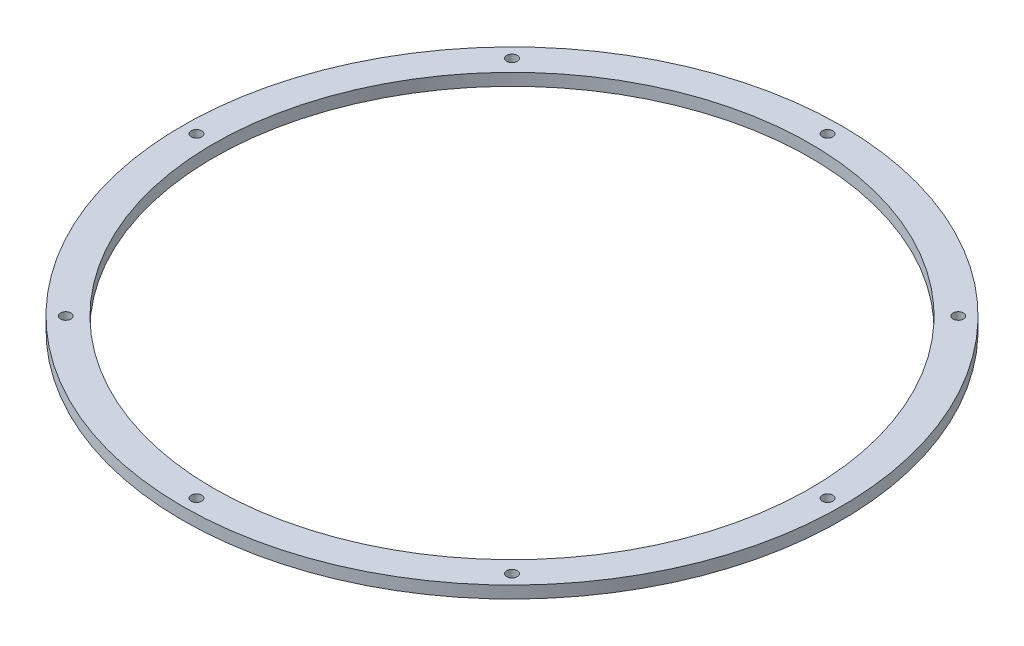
ISO-10303-21;
HEADER;
FILE_DESCRIPTION(('STEP AP214'),'2;1');
FILE_NAME('part.step','',(''),(''),'','','');
FILE_SCHEMA(('AUTOMOTIVE_DESIGN { 1 0 10303 214 1 1 1 1 }'));
ENDSEC;
DATA;
#1=APPLICATION_CONTEXT('core data for automotive mechanical design processes');
#2=APPLICATION_PROTOCOL_DEFINITION('international standard','automotive_design',2000,#1);
#3=PRODUCT_CONTEXT('',#1,'mechanical');
#4=PRODUCT('Part','Part','',(#3));
#5=PRODUCT_RELATED_PRODUCT_CATEGORY('part','',(#4));
#6=PRODUCT_DEFINITION_FORMATION('','',#4);
#7=PRODUCT_DEFINITION_CONTEXT('part definition',#1,'design');
#8=PRODUCT_DEFINITION('design','',#6,#7);
#9=PRODUCT_DEFINITION_SHAPE('','',#8);
#10=(LENGTH_UNIT() NAMED_UNIT(*) SI_UNIT(.MILLI.,.METRE.));
#11=(NAMED_UNIT(*) PLANE_ANGLE_UNIT() SI_UNIT($,.RADIAN.));
#12=(NAMED_UNIT(*) SI_UNIT($,.STERADIAN.) SOLID_ANGLE_UNIT());
#13=UNCERTAINTY_MEASURE_WITH_UNIT(LENGTH_MEASURE(1.E-05),#10,'distance_accuracy_value','');
#14=(GEOMETRIC_REPRESENTATION_CONTEXT(3) GLOBAL_UNCERTAINTY_ASSIGNED_CONTEXT((#13)) GLOBAL_UNIT_ASSIGNED_CONTEXT((#10,
#11,#12)) REPRESENTATION_CONTEXT('',''));
#15=CARTESIAN_POINT('',(0.,0.,0.));
#16=DIRECTION('',(0.,0.,1.));
#17=DIRECTION('',(1.,0.,0.));
#18=AXIS2_PLACEMENT_3D('',#15,#16,#17);
#19=CARTESIAN_POINT('',(0.,4.953,0.));
#20=DIRECTION('',(0.,1.,0.));
#21=DIRECTION('',(0.,0.,1.));
#22=AXIS2_PLACEMENT_3D('',#19,#20,#21);
#23=PLANE('',#22);
#24=CARTESIAN_POINT('',(91.1495996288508,4.953,-91.149599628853));
#25=DIRECTION('',(0.,1.,0.));
#26=DIRECTION('',(0.,0.,1.));
#27=AXIS2_PLACEMENT_3D('',#24,#25,#26);
#28=CIRCLE('',#27,2.15);
#29=CARTESIAN_POINT('',(91.1495996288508,4.953,-88.999599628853));
#30=VERTEX_POINT('',#29);
#31=EDGE_CURVE('E102',#30,#30,#28,.T.);
#32=ORIENTED_EDGE('',*,*,#31,.F.);
#33=EDGE_LOOP('',(#32));
#34=FACE_BOUND('',#33,.T.);
#35=CARTESIAN_POINT('',(128.905,4.953,-1.35020820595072E-12));
#36=DIRECTION('',(0.,1.,0.));
#37=DIRECTION('',(0.,0.,1.));
#38=AXIS2_PLACEMENT_3D('',#35,#36,#37);
#39=CIRCLE('',#38,2.15000000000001);
#40=CARTESIAN_POINT('',(128.905,4.953,2.14999999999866));
#41=VERTEX_POINT('',#40);
#42=EDGE_CURVE('E96',#41,#41,#39,.T.);
#43=ORIENTED_EDGE('',*,*,#42,.F.);
#44=EDGE_LOOP('',(#43));
#45=FACE_BOUND('',#44,.T.);
#46=CARTESIAN_POINT('',(91.1495996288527,4.953,91.1495996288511));
#47=DIRECTION('',(0.,1.,0.));
#48=DIRECTION('',(0.,0.,1.));
#49=AXIS2_PLACEMENT_3D('',#46,#47,#48);
#50=CIRCLE('',#49,2.15);
#51=CARTESIAN_POINT('',(91.1495996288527,4.953,93.2995996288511));
#52=VERTEX_POINT('',#51);
#53=EDGE_CURVE('E90',#52,#52,#50,.T.);
#54=ORIENTED_EDGE('',*,*,#53,.F.);
#55=EDGE_LOOP('',(#54));
#56=FACE_BOUND('',#55,.T.);
#57=CARTESIAN_POINT('',(0.,4.953,128.905));
#58=DIRECTION('',(0.,1.,0.));
#59=DIRECTION('',(0.,0.,1.));
#60=AXIS2_PLACEMENT_3D('',#57,#58,#59);
#61=CIRCLE('',#60,2.15);
#62=CARTESIAN_POINT('',(0.,4.953,131.055));
#63=VERTEX_POINT('',#62);
#64=EDGE_CURVE('E84',#63,#63,#61,.T.);
#65=ORIENTED_EDGE('',*,*,#64,.F.);
#66=EDGE_LOOP('',(#65));
#67=FACE_BOUND('',#66,.T.);
#68=CARTESIAN_POINT('',(-91.1495996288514,4.953,91.1495996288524));
#69=DIRECTION('',(0.,1.,0.));
#70=DIRECTION('',(0.,0.,1.));
#71=AXIS2_PLACEMENT_3D('',#68,#69,#70);
#72=CIRCLE('',#71,2.15);
#73=CARTESIAN_POINT('',(-91.1495996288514,4.953,93.2995996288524));
#74=VERTEX_POINT('',#73);
#75=EDGE_CURVE('E78',#74,#74,#72,.T.);
#76=ORIENTED_EDGE('',*,*,#75,.F.);
#77=EDGE_LOOP('',(#76));
#78=FACE_BOUND('',#77,.T.);
#79=CARTESIAN_POINT('',(-128.905,4.953,4.50069401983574E-13));
#80=DIRECTION('',(0.,1.,0.));
#81=DIRECTION('',(0.,0.,1.));
#82=AXIS2_PLACEMENT_3D('',#79,#80,#81);
#83=CIRCLE('',#82,2.15000000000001);
#84=CARTESIAN_POINT('',(-128.905,4.953,2.15000000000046));
#85=VERTEX_POINT('',#84);
#86=EDGE_CURVE('E72',#85,#85,#83,.T.);
#87=ORIENTED_EDGE('',*,*,#86,.F.);
#88=EDGE_LOOP('',(#87));
#89=FACE_BOUND('',#88,.T.);
#90=CARTESIAN_POINT('',(-91.1495996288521,4.953,-91.1495996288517));
#91=DIRECTION('',(0.,1.,0.));
#92=DIRECTION('',(0.,0.,1.));
#93=AXIS2_PLACEMENT_3D('',#90,#91,#92);
#94=CIRCLE('',#93,2.15);
#95=CARTESIAN_POINT('',(-91.1495996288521,4.953,-88.9995996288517));
#96=VERTEX_POINT('',#95);
#97=EDGE_CURVE('E66',#96,#96,#94,.T.);
#98=ORIENTED_EDGE('',*,*,#97,.F.);
#99=EDGE_LOOP('',(#98));
#100=FACE_BOUND('',#99,.T.);
#101=CARTESIAN_POINT('',(0.,4.953,-128.905));
#102=DIRECTION('',(0.,1.,0.));
#103=DIRECTION('',(0.,0.,1.));
#104=AXIS2_PLACEMENT_3D('',#101,#102,#103);
#105=CIRCLE('',#104,2.15);
#106=CARTESIAN_POINT('',(0.,4.953,-126.755));
#107=VERTEX_POINT('',#106);
#108=EDGE_CURVE('E60',#107,#107,#105,.T.);
#109=ORIENTED_EDGE('',*,*,#108,.F.);
#110=EDGE_LOOP('',(#109));
#111=FACE_BOUND('',#110,.T.);
#112=CARTESIAN_POINT('',(0.,4.953,0.));
#113=DIRECTION('',(0.,1.,0.));
#114=DIRECTION('',(0.,0.,1.));
#115=AXIS2_PLACEMENT_3D('',#112,#113,#114);
#116=CIRCLE('',#115,134.62);
#117=CARTESIAN_POINT('',(0.,4.953,134.62));
#118=VERTEX_POINT('',#117);
#119=EDGE_CURVE('E10',#118,#118,#116,.T.);
#120=ORIENTED_EDGE('',*,*,#119,.T.);
#121=EDGE_LOOP('',(#120));
#122=FACE_BOUND('',#121,.T.);
#123=CARTESIAN_POINT('',(0.,4.953,0.));
#124=DIRECTION('',(0.,1.,0.));
#125=DIRECTION('',(0.,0.,1.));
#126=AXIS2_PLACEMENT_3D('',#123,#124,#125);
#127=CIRCLE('',#126,121.92);
#128=CARTESIAN_POINT('',(0.,4.953,121.92));
#129=VERTEX_POINT('',#128);
#130=EDGE_CURVE('E50',#129,#129,#127,.T.);
#131=ORIENTED_EDGE('',*,*,#130,.F.);
#132=EDGE_LOOP('',(#131));
#133=FACE_BOUND('',#132,.T.);
#134=ADVANCED_FACE('F39',(#34,#45,#56,#67,#78,#89,#100,#111,#122,#133),#23,.T.);
#135=CARTESIAN_POINT('',(0.,0.,0.));
#136=DIRECTION('',(0.,1.,0.));
#137=DIRECTION('',(0.,0.,1.));
#138=AXIS2_PLACEMENT_3D('',#135,#136,#137);
#139=PLANE('',#138);
#140=CARTESIAN_POINT('',(91.1495996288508,0.,-91.149599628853));
#141=DIRECTION('',(0.,1.,0.));
#142=DIRECTION('',(0.,0.,1.));
#143=AXIS2_PLACEMENT_3D('',#140,#141,#142);
#144=CIRCLE('',#143,2.15);
#145=CARTESIAN_POINT('',(91.1495996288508,0.,-88.999599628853));
#146=VERTEX_POINT('',#145);
#147=EDGE_CURVE('E99',#146,#146,#144,.T.);
#148=ORIENTED_EDGE('',*,*,#147,.T.);
#149=EDGE_LOOP('',(#148));
#150=FACE_BOUND('',#149,.T.);
#151=CARTESIAN_POINT('',(128.905,0.,-1.35020820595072E-12));
#152=DIRECTION('',(0.,1.,0.));
#153=DIRECTION('',(0.,0.,1.));
#154=AXIS2_PLACEMENT_3D('',#151,#152,#153);
#155=CIRCLE('',#154,2.14999999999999);
#156=CARTESIAN_POINT('',(128.905,0.,2.14999999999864));
#157=VERTEX_POINT('',#156);
#158=EDGE_CURVE('E93',#157,#157,#155,.T.);
#159=ORIENTED_EDGE('',*,*,#158,.T.);
#160=EDGE_LOOP('',(#159));
#161=FACE_BOUND('',#160,.T.);
#162=CARTESIAN_POINT('',(91.1495996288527,0.,91.1495996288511));
#163=DIRECTION('',(0.,1.,0.));
#164=DIRECTION('',(0.,0.,1.));
#165=AXIS2_PLACEMENT_3D('',#162,#163,#164);
#166=CIRCLE('',#165,2.15);
#167=CARTESIAN_POINT('',(91.1495996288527,0.,93.2995996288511));
#168=VERTEX_POINT('',#167);
#169=EDGE_CURVE('E87',#168,#168,#166,.T.);
#170=ORIENTED_EDGE('',*,*,#169,.T.);
#171=EDGE_LOOP('',(#170));
#172=FACE_BOUND('',#171,.T.);
#173=CARTESIAN_POINT('',(0.,0.,128.905));
#174=DIRECTION('',(0.,1.,0.));
#175=DIRECTION('',(0.,0.,1.));
#176=AXIS2_PLACEMENT_3D('',#173,#174,#175);
#177=CIRCLE('',#176,2.15);
#178=CARTESIAN_POINT('',(0.,0.,131.055));
#179=VERTEX_POINT('',#178);
#180=EDGE_CURVE('E81',#179,#179,#177,.T.);
#181=ORIENTED_EDGE('',*,*,#180,.T.);
#182=EDGE_LOOP('',(#181));
#183=FACE_BOUND('',#182,.T.);
#184=CARTESIAN_POINT('',(-91.1495996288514,0.,91.1495996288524));
#185=DIRECTION('',(0.,1.,0.));
#186=DIRECTION('',(0.,0.,1.));
#187=AXIS2_PLACEMENT_3D('',#184,#185,#186);
#188=CIRCLE('',#187,2.15);
#189=CARTESIAN_POINT('',(-91.1495996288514,0.,93.2995996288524));
#190=VERTEX_POINT('',#189);
#191=EDGE_CURVE('E75',#190,#190,#188,.T.);
#192=ORIENTED_EDGE('',*,*,#191,.T.);
#193=EDGE_LOOP('',(#192));
#194=FACE_BOUND('',#193,.T.);
#195=CARTESIAN_POINT('',(-128.905,0.,4.50069401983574E-13));
#196=DIRECTION('',(0.,1.,0.));
#197=DIRECTION('',(0.,0.,1.));
#198=AXIS2_PLACEMENT_3D('',#195,#196,#197);
#199=CIRCLE('',#198,2.14999999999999);
#200=CARTESIAN_POINT('',(-128.905,0.,2.15000000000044));
#201=VERTEX_POINT('',#200);
#202=EDGE_CURVE('E69',#201,#201,#199,.T.);
#203=ORIENTED_EDGE('',*,*,#202,.T.);
#204=EDGE_LOOP('',(#203));
#205=FACE_BOUND('',#204,.T.);
#206=CARTESIAN_POINT('',(-91.1495996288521,0.,-91.1495996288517));
#207=DIRECTION('',(0.,1.,0.));
#208=DIRECTION('',(0.,0.,1.));
#209=AXIS2_PLACEMENT_3D('',#206,#207,#208);
#210=CIRCLE('',#209,2.15);
#211=CARTESIAN_POINT('',(-91.1495996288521,0.,-88.9995996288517));
#212=VERTEX_POINT('',#211);
#213=EDGE_CURVE('E63',#212,#212,#210,.T.);
#214=ORIENTED_EDGE('',*,*,#213,.T.);
#215=EDGE_LOOP('',(#214));
#216=FACE_BOUND('',#215,.T.);
#217=CARTESIAN_POINT('',(0.,0.,-128.905));
#218=DIRECTION('',(0.,1.,0.));
#219=DIRECTION('',(0.,0.,1.));
#220=AXIS2_PLACEMENT_3D('',#217,#218,#219);
#221=CIRCLE('',#220,2.15);
#222=CARTESIAN_POINT('',(0.,0.,-126.755));
#223=VERTEX_POINT('',#222);
#224=EDGE_CURVE('E55',#223,#223,#221,.T.);
#225=ORIENTED_EDGE('',*,*,#224,.T.);
#226=EDGE_LOOP('',(#225));
#227=FACE_BOUND('',#226,.T.);
#228=CARTESIAN_POINT('',(0.,0.,0.));
#229=DIRECTION('',(0.,1.,0.));
#230=DIRECTION('',(0.,0.,1.));
#231=AXIS2_PLACEMENT_3D('',#228,#229,#230);
#232=CIRCLE('',#231,134.62);
#233=CARTESIAN_POINT('',(0.,0.,134.62));
#234=VERTEX_POINT('',#233);
#235=EDGE_CURVE('E43',#234,#234,#232,.T.);
#236=ORIENTED_EDGE('',*,*,#235,.F.);
#237=EDGE_LOOP('',(#236));
#238=FACE_BOUND('',#237,.T.);
#239=CARTESIAN_POINT('',(0.,0.,0.));
#240=DIRECTION('',(0.,1.,0.));
#241=DIRECTION('',(0.,0.,1.));
#242=AXIS2_PLACEMENT_3D('',#239,#240,#241);
#243=CIRCLE('',#242,121.92);
#244=CARTESIAN_POINT('',(0.,0.,121.92));
#245=VERTEX_POINT('',#244);
#246=EDGE_CURVE('E52',#245,#245,#243,.T.);
#247=ORIENTED_EDGE('',*,*,#246,.T.);
#248=EDGE_LOOP('',(#247));
#249=FACE_BOUND('',#248,.T.);
#250=ADVANCED_FACE('F110',(#150,#161,#172,#183,#194,#205,#216,#227,#238,#249),#139,.F.);
#251=CARTESIAN_POINT('',(0.,4.953,0.));
#252=DIRECTION('',(0.,-1.,0.));
#253=DIRECTION('',(0.,0.,-1.));
#254=AXIS2_PLACEMENT_3D('',#251,#252,#253);
#255=CYLINDRICAL_SURFACE('',#254,134.62);
#256=ORIENTED_EDGE('',*,*,#119,.F.);
#257=EDGE_LOOP('',(#256));
#258=FACE_BOUND('',#257,.T.);
#259=ORIENTED_EDGE('',*,*,#235,.T.);
#260=EDGE_LOOP('',(#259));
#261=FACE_BOUND('',#260,.T.);
#262=ADVANCED_FACE('F41',(#258,#261),#255,.T.);
#263=CARTESIAN_POINT('',(0.,4.953,0.));
#264=DIRECTION('',(0.,-1.,0.));
#265=DIRECTION('',(0.,0.,-1.));
#266=AXIS2_PLACEMENT_3D('',#263,#264,#265);
#267=CYLINDRICAL_SURFACE('',#266,121.92);
#268=ORIENTED_EDGE('',*,*,#130,.T.);
#269=EDGE_LOOP('',(#268));
#270=FACE_BOUND('',#269,.T.);
#271=ORIENTED_EDGE('',*,*,#246,.F.);
#272=EDGE_LOOP('',(#271));
#273=FACE_BOUND('',#272,.T.);
#274=ADVANCED_FACE('F128',(#270,#273),#267,.F.);
#275=CARTESIAN_POINT('',(0.,4.953,-128.905));
#276=DIRECTION('',(0.,1.,0.));
#277=DIRECTION('',(0.,0.,1.));
#278=AXIS2_PLACEMENT_3D('',#275,#276,#277);
#279=CYLINDRICAL_SURFACE('',#278,2.15);
#280=ORIENTED_EDGE('',*,*,#224,.F.);
#281=EDGE_LOOP('',(#280));
#282=FACE_BOUND('',#281,.T.);
#283=ORIENTED_EDGE('',*,*,#108,.T.);
#284=EDGE_LOOP('',(#283));
#285=FACE_BOUND('',#284,.T.);
#286=ADVANCED_FACE('F131',(#282,#285),#279,.F.);
#287=CARTESIAN_POINT('',(-91.1495996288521,4.953,-91.1495996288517));
#288=DIRECTION('',(0.,1.,0.));
#289=DIRECTION('',(0.,0.,1.));
#290=AXIS2_PLACEMENT_3D('',#287,#288,#289);
#291=CYLINDRICAL_SURFACE('',#290,2.15);
#292=ORIENTED_EDGE('',*,*,#213,.F.);
#293=EDGE_LOOP('',(#292));
#294=FACE_BOUND('',#293,.T.);
#295=ORIENTED_EDGE('',*,*,#97,.T.);
#296=EDGE_LOOP('',(#295));
#297=FACE_BOUND('',#296,.T.);
#298=ADVANCED_FACE('F145',(#294,#297),#291,.F.);
#299=CARTESIAN_POINT('',(-128.905,4.953,4.50069401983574E-13));
#300=DIRECTION('',(0.,1.,0.));
#301=DIRECTION('',(0.,0.,1.));
#302=AXIS2_PLACEMENT_3D('',#299,#300,#301);
#303=CYLINDRICAL_SURFACE('',#302,2.15);
#304=ORIENTED_EDGE('',*,*,#202,.F.);
#305=EDGE_LOOP('',(#304));
#306=FACE_BOUND('',#305,.T.);
#307=ORIENTED_EDGE('',*,*,#86,.T.);
#308=EDGE_LOOP('',(#307));
#309=FACE_BOUND('',#308,.T.);
#310=ADVANCED_FACE('F149',(#306,#309),#303,.F.);
#311=CARTESIAN_POINT('',(-91.1495996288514,4.953,91.1495996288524));
#312=DIRECTION('',(0.,1.,0.));
#313=DIRECTION('',(0.,0.,1.));
#314=AXIS2_PLACEMENT_3D('',#311,#312,#313);
#315=CYLINDRICAL_SURFACE('',#314,2.15);
#316=ORIENTED_EDGE('',*,*,#191,.F.);
#317=EDGE_LOOP('',(#316));
#318=FACE_BOUND('',#317,.T.);
#319=ORIENTED_EDGE('',*,*,#75,.T.);
#320=EDGE_LOOP('',(#319));
#321=FACE_BOUND('',#320,.T.);
#322=ADVANCED_FACE('F153',(#318,#321),#315,.F.);
#323=CARTESIAN_POINT('',(0.,4.953,128.905));
#324=DIRECTION('',(0.,1.,0.));
#325=DIRECTION('',(0.,0.,1.));
#326=AXIS2_PLACEMENT_3D('',#323,#324,#325);
#327=CYLINDRICAL_SURFACE('',#326,2.15);
#328=ORIENTED_EDGE('',*,*,#180,.F.);
#329=EDGE_LOOP('',(#328));
#330=FACE_BOUND('',#329,.T.);
#331=ORIENTED_EDGE('',*,*,#64,.T.);
#332=EDGE_LOOP('',(#331));
#333=FACE_BOUND('',#332,.T.);
#334=ADVANCED_FACE('F157',(#330,#333),#327,.F.);
#335=CARTESIAN_POINT('',(91.1495996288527,4.953,91.1495996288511));
#336=DIRECTION('',(0.,1.,0.));
#337=DIRECTION('',(0.,0.,1.));
#338=AXIS2_PLACEMENT_3D('',#335,#336,#337);
#339=CYLINDRICAL_SURFACE('',#338,2.15);
#340=ORIENTED_EDGE('',*,*,#169,.F.);
#341=EDGE_LOOP('',(#340));
#342=FACE_BOUND('',#341,.T.);
#343=ORIENTED_EDGE('',*,*,#53,.T.);
#344=EDGE_LOOP('',(#343));
#345=FACE_BOUND('',#344,.T.);
#346=ADVANCED_FACE('F161',(#342,#345),#339,.F.);
#347=CARTESIAN_POINT('',(128.905,4.953,-1.35020820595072E-12));
#348=DIRECTION('',(0.,1.,0.));
#349=DIRECTION('',(0.,0.,1.));
#350=AXIS2_PLACEMENT_3D('',#347,#348,#349);
#351=CYLINDRICAL_SURFACE('',#350,2.15);
#352=ORIENTED_EDGE('',*,*,#158,.F.);
#353=EDGE_LOOP('',(#352));
#354=FACE_BOUND('',#353,.T.);
#355=ORIENTED_EDGE('',*,*,#42,.T.);
#356=EDGE_LOOP('',(#355));
#357=FACE_BOUND('',#356,.T.);
#358=ADVANCED_FACE('F165',(#354,#357),#351,.F.);
#359=CARTESIAN_POINT('',(91.1495996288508,4.953,-91.149599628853));
#360=DIRECTION('',(0.,1.,0.));
#361=DIRECTION('',(0.,0.,1.));
#362=AXIS2_PLACEMENT_3D('',#359,#360,#361);
#363=CYLINDRICAL_SURFACE('',#362,2.15);
#364=ORIENTED_EDGE('',*,*,#147,.F.);
#365=EDGE_LOOP('',(#364));
#366=FACE_BOUND('',#365,.T.);
#367=ORIENTED_EDGE('',*,*,#31,.T.);
#368=EDGE_LOOP('',(#367));
#369=FACE_BOUND('',#368,.T.);
#370=ADVANCED_FACE('F106',(#366,#369),#363,.F.);
#371=CLOSED_SHELL('',(#134,#250,#262,#274,#286,#298,#310,#322,#334,#346,#358,#370));
#372=MANIFOLD_SOLID_BREP('B2',#371);
#373=ADVANCED_BREP_SHAPE_REPRESENTATION('',(#18,#372),#14);
#374=SHAPE_DEFINITION_REPRESENTATION(#9,#373);
ENDSEC;
END-ISO-10303-21;
